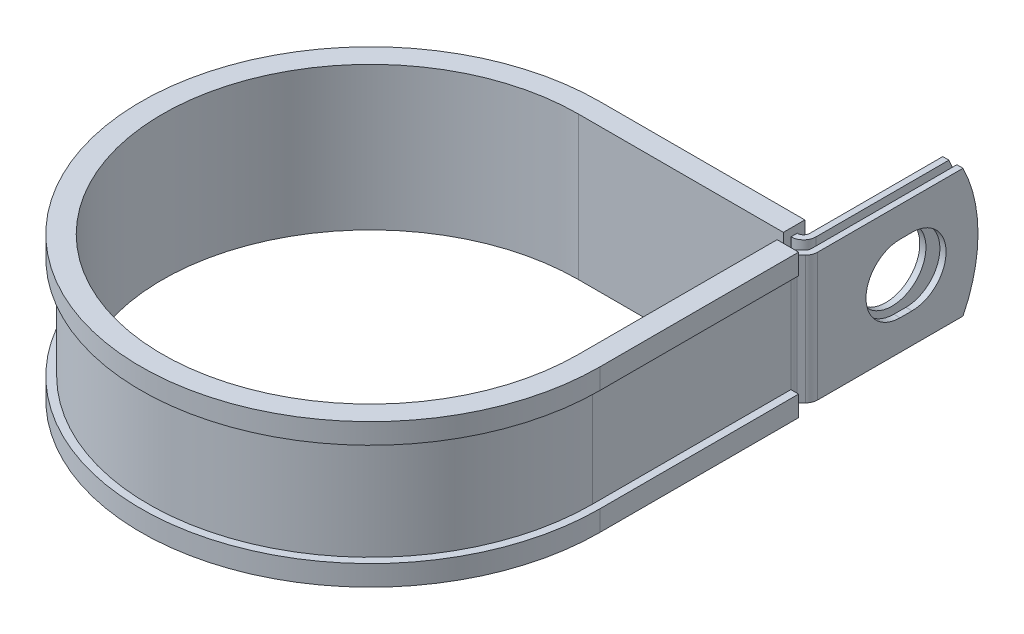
ISO-10303-21;
HEADER;
FILE_DESCRIPTION(('STEP AP214'),'2;1');
FILE_NAME('part.step','',(''),(''),'','','');
FILE_SCHEMA(('AUTOMOTIVE_DESIGN { 1 0 10303 214 1 1 1 1 }'));
ENDSEC;
DATA;
#1=APPLICATION_CONTEXT('core data for automotive mechanical design processes');
#2=APPLICATION_PROTOCOL_DEFINITION('international standard','automotive_design',2000,#1);
#3=PRODUCT_CONTEXT('',#1,'mechanical');
#4=PRODUCT('Part','Part','',(#3));
#5=PRODUCT_RELATED_PRODUCT_CATEGORY('part','',(#4));
#6=PRODUCT_DEFINITION_FORMATION('','',#4);
#7=PRODUCT_DEFINITION_CONTEXT('part definition',#1,'design');
#8=PRODUCT_DEFINITION('design','',#6,#7);
#9=PRODUCT_DEFINITION_SHAPE('','',#8);
#10=(LENGTH_UNIT() NAMED_UNIT(*) SI_UNIT(.MILLI.,.METRE.));
#11=(NAMED_UNIT(*) PLANE_ANGLE_UNIT() SI_UNIT($,.RADIAN.));
#12=(NAMED_UNIT(*) SI_UNIT($,.STERADIAN.) SOLID_ANGLE_UNIT());
#13=UNCERTAINTY_MEASURE_WITH_UNIT(LENGTH_MEASURE(1.E-05),#10,'distance_accuracy_value','');
#14=(GEOMETRIC_REPRESENTATION_CONTEXT(3) GLOBAL_UNCERTAINTY_ASSIGNED_CONTEXT((#13)) GLOBAL_UNIT_ASSIGNED_CONTEXT((#10,
#11,#12)) REPRESENTATION_CONTEXT('',''));
#15=CARTESIAN_POINT('',(0.,0.,0.));
#16=DIRECTION('',(0.,0.,1.));
#17=DIRECTION('',(1.,0.,0.));
#18=AXIS2_PLACEMENT_3D('',#15,#16,#17);
#19=CARTESIAN_POINT('',(43.4772698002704,-12.7,-42.799));
#20=DIRECTION('',(0.,1.,0.));
#21=DIRECTION('',(1.,0.,0.));
#22=AXIS2_PLACEMENT_3D('',#19,#20,#21);
#23=PLANE('',#22);
#24=DIRECTION('',(0.,0.,-1.));
#25=VECTOR('',#24,1.);
#26=CARTESIAN_POINT('',(40.6324698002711,-12.7,-42.799));
#27=LINE('',#26,#25);
#28=CARTESIAN_POINT('',(40.6324698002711,-12.7,-42.799));
#29=VERTEX_POINT('',#28);
#30=CARTESIAN_POINT('',(40.6324698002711,-12.7,-44.0182));
#31=VERTEX_POINT('',#30);
#32=EDGE_CURVE('E524',#29,#31,#27,.T.);
#33=ORIENTED_EDGE('',*,*,#32,.T.);
#34=DIRECTION('',(1.,0.,0.));
#35=VECTOR('',#34,1.);
#36=CARTESIAN_POINT('',(0.,-12.7,-44.0182));
#37=LINE('',#36,#35);
#38=CARTESIAN_POINT('',(40.6832698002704,-12.7,-44.0182));
#39=VERTEX_POINT('',#38);
#40=EDGE_CURVE('E411',#39,#31,#37,.F.);
#41=ORIENTED_EDGE('',*,*,#40,.F.);
#42=CARTESIAN_POINT('',(40.6832698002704,-12.7,-45.2374));
#43=DIRECTION('',(0.,1.,0.));
#44=DIRECTION('',(1.,0.,0.));
#45=AXIS2_PLACEMENT_3D('',#42,#43,#44);
#46=CIRCLE('',#45,1.2192);
#47=CARTESIAN_POINT('',(41.9024698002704,-12.7,-45.2374));
#48=VERTEX_POINT('',#47);
#49=EDGE_CURVE('E409',#48,#39,#46,.F.);
#50=ORIENTED_EDGE('',*,*,#49,.F.);
#51=DIRECTION('',(0.,0.,-1.));
#52=VECTOR('',#51,1.);
#53=CARTESIAN_POINT('',(41.9024698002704,-12.7,-74.5998));
#54=LINE('',#53,#52);
#55=CARTESIAN_POINT('',(41.9024698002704,-12.7,-71.6224683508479));
#56=VERTEX_POINT('',#55);
#57=EDGE_CURVE('E407',#56,#48,#54,.F.);
#58=ORIENTED_EDGE('',*,*,#57,.F.);
#59=DIRECTION('',(-1.,0.,0.));
#60=VECTOR('',#59,1.);
#61=CARTESIAN_POINT('',(45.9156698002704,-12.7,-71.6224683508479));
#62=LINE('',#61,#60);
#63=CARTESIAN_POINT('',(43.1216698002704,-12.7,-71.6224683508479));
#64=VERTEX_POINT('',#63);
#65=EDGE_CURVE('E12',#64,#56,#62,.T.);
#66=ORIENTED_EDGE('',*,*,#65,.F.);
#67=DIRECTION('',(0.,0.,1.));
#68=VECTOR('',#67,1.);
#69=CARTESIAN_POINT('',(43.1216698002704,-12.7,-74.5998));
#70=LINE('',#69,#68);
#71=CARTESIAN_POINT('',(43.1216698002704,-12.7,-45.2374));
#72=VERTEX_POINT('',#71);
#73=EDGE_CURVE('E405',#64,#72,#70,.T.);
#74=ORIENTED_EDGE('',*,*,#73,.T.);
#75=CARTESIAN_POINT('',(40.6832698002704,-12.7,-45.2374));
#76=DIRECTION('',(0.,-1.,0.));
#77=DIRECTION('',(0.,0.,1.));
#78=AXIS2_PLACEMENT_3D('',#75,#76,#77);
#79=CIRCLE('',#78,2.4384);
#80=CARTESIAN_POINT('',(40.6832698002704,-12.7,-42.799));
#81=VERTEX_POINT('',#80);
#82=EDGE_CURVE('E402',#72,#81,#79,.T.);
#83=ORIENTED_EDGE('',*,*,#82,.T.);
#84=DIRECTION('',(-1.,0.,0.));
#85=VECTOR('',#84,1.);
#86=CARTESIAN_POINT('',(0.,-12.7,-42.799));
#87=LINE('',#86,#85);
#88=EDGE_CURVE('E399',#81,#29,#87,.T.);
#89=ORIENTED_EDGE('',*,*,#88,.T.);
#90=EDGE_LOOP('',(#33,#41,#50,#58,#66,#74,#83,#89));
#91=FACE_BOUND('',#90,.T.);
#92=ADVANCED_FACE('F55',(#91),#23,.F.);
#93=CARTESIAN_POINT('',(43.4772698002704,12.7,-42.799));
#94=DIRECTION('',(0.,1.,0.));
#95=DIRECTION('',(1.,0.,0.));
#96=AXIS2_PLACEMENT_3D('',#93,#94,#95);
#97=PLANE('',#96);
#98=DIRECTION('',(1.,0.,0.));
#99=VECTOR('',#98,1.);
#100=CARTESIAN_POINT('',(0.,12.7,-44.0182));
#101=LINE('',#100,#99);
#102=CARTESIAN_POINT('',(40.6832698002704,12.7,-44.0182));
#103=VERTEX_POINT('',#102);
#104=CARTESIAN_POINT('',(40.6324698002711,12.7,-44.0182));
#105=VERTEX_POINT('',#104);
#106=EDGE_CURVE('E369',#103,#105,#101,.F.);
#107=ORIENTED_EDGE('',*,*,#106,.T.);
#108=DIRECTION('',(0.,0.,1.));
#109=VECTOR('',#108,1.);
#110=CARTESIAN_POINT('',(40.6324698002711,12.7,-44.0182));
#111=LINE('',#110,#109);
#112=CARTESIAN_POINT('',(40.6324698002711,12.7,-42.799));
#113=VERTEX_POINT('',#112);
#114=EDGE_CURVE('E518',#105,#113,#111,.T.);
#115=ORIENTED_EDGE('',*,*,#114,.T.);
#116=DIRECTION('',(-1.,0.,0.));
#117=VECTOR('',#116,1.);
#118=CARTESIAN_POINT('',(0.,12.7,-42.799));
#119=LINE('',#118,#117);
#120=CARTESIAN_POINT('',(40.6832698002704,12.7,-42.799));
#121=VERTEX_POINT('',#120);
#122=EDGE_CURVE('E626',#121,#113,#119,.T.);
#123=ORIENTED_EDGE('',*,*,#122,.F.);
#124=CARTESIAN_POINT('',(40.6832698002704,12.7,-45.2374));
#125=DIRECTION('',(0.,-1.,0.));
#126=DIRECTION('',(0.,0.,1.));
#127=AXIS2_PLACEMENT_3D('',#124,#125,#126);
#128=CIRCLE('',#127,2.4384);
#129=CARTESIAN_POINT('',(43.1216698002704,12.7,-45.2374));
#130=VERTEX_POINT('',#129);
#131=EDGE_CURVE('E371',#130,#121,#128,.T.);
#132=ORIENTED_EDGE('',*,*,#131,.F.);
#133=DIRECTION('',(0.,0.,1.));
#134=VECTOR('',#133,1.);
#135=CARTESIAN_POINT('',(43.1216698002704,12.7,-74.5998));
#136=LINE('',#135,#134);
#137=CARTESIAN_POINT('',(43.1216698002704,12.7,-71.6224683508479));
#138=VERTEX_POINT('',#137);
#139=EDGE_CURVE('E362',#138,#130,#136,.T.);
#140=ORIENTED_EDGE('',*,*,#139,.F.);
#141=DIRECTION('',(-1.,0.,0.));
#142=VECTOR('',#141,1.);
#143=CARTESIAN_POINT('',(45.9156698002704,12.7,-71.6224683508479));
#144=LINE('',#143,#142);
#145=CARTESIAN_POINT('',(41.9024698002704,12.7,-71.6224683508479));
#146=VERTEX_POINT('',#145);
#147=EDGE_CURVE('E63',#138,#146,#144,.T.);
#148=ORIENTED_EDGE('',*,*,#147,.T.);
#149=DIRECTION('',(0.,0.,-1.));
#150=VECTOR('',#149,1.);
#151=CARTESIAN_POINT('',(41.9024698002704,12.7,-74.5998));
#152=LINE('',#151,#150);
#153=CARTESIAN_POINT('',(41.9024698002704,12.7,-45.2374));
#154=VERTEX_POINT('',#153);
#155=EDGE_CURVE('E359',#146,#154,#152,.F.);
#156=ORIENTED_EDGE('',*,*,#155,.T.);
#157=CARTESIAN_POINT('',(40.6832698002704,12.7,-45.2374));
#158=DIRECTION('',(0.,1.,0.));
#159=DIRECTION('',(1.,0.,0.));
#160=AXIS2_PLACEMENT_3D('',#157,#158,#159);
#161=CIRCLE('',#160,1.2192);
#162=EDGE_CURVE('E367',#154,#103,#161,.F.);
#163=ORIENTED_EDGE('',*,*,#162,.T.);
#164=EDGE_LOOP('',(#107,#115,#123,#132,#140,#148,#156,#163));
#165=FACE_BOUND('',#164,.T.);
#166=ADVANCED_FACE('F358',(#165),#97,.T.);
#167=CARTESIAN_POINT('',(0.,12.7,-42.799));
#168=DIRECTION('',(0.,0.,1.));
#169=DIRECTION('',(1.,0.,0.));
#170=AXIS2_PLACEMENT_3D('',#167,#168,#169);
#171=PLANE('',#170);
#172=ORIENTED_EDGE('',*,*,#122,.T.);
#173=DIRECTION('',(0.,-1.,0.));
#174=VECTOR('',#173,1.);
#175=CARTESIAN_POINT('',(40.6324698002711,12.7,-42.799));
#176=LINE('',#175,#174);
#177=EDGE_CURVE('E521',#113,#29,#176,.T.);
#178=ORIENTED_EDGE('',*,*,#177,.T.);
#179=ORIENTED_EDGE('',*,*,#88,.F.);
#180=DIRECTION('',(0.,-1.,0.));
#181=VECTOR('',#180,1.);
#182=CARTESIAN_POINT('',(40.6832698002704,12.7,-42.799));
#183=LINE('',#182,#181);
#184=EDGE_CURVE('E345',#121,#81,#183,.T.);
#185=ORIENTED_EDGE('',*,*,#184,.F.);
#186=EDGE_LOOP('',(#172,#178,#179,#185));
#187=FACE_BOUND('',#186,.T.);
#188=ADVANCED_FACE('F636',(#187),#171,.T.);
#189=CARTESIAN_POINT('',(45.9156698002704,12.7,-42.799));
#190=DIRECTION('',(-1.,0.,0.));
#191=DIRECTION('',(0.,0.,1.));
#192=AXIS2_PLACEMENT_3D('',#189,#190,#191);
#193=PLANE('',#192);
#194=CARTESIAN_POINT('',(45.9156698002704,0.,-61.5187999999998));
#195=DIRECTION('',(1.,0.,0.));
#196=DIRECTION('',(0.,0.,-1.));
#197=AXIS2_PLACEMENT_3D('',#194,#195,#196);
#198=CIRCLE('',#197,6.7437);
#199=CARTESIAN_POINT('',(45.9156698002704,-6.7437,-61.5188000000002));
#200=VERTEX_POINT('',#199);
#201=CARTESIAN_POINT('',(45.9156698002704,6.7437,-61.5188000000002));
#202=VERTEX_POINT('',#201);
#203=EDGE_CURVE('E581',#200,#202,#198,.T.);
#204=ORIENTED_EDGE('',*,*,#203,.F.);
#205=DIRECTION('',(0.,0.,-1.));
#206=VECTOR('',#205,1.);
#207=CARTESIAN_POINT('',(45.9156698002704,-6.7437,-59.1311999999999));
#208=LINE('',#207,#206);
#209=CARTESIAN_POINT('',(45.9156698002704,-6.7437,-59.1311999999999));
#210=VERTEX_POINT('',#209);
#211=EDGE_CURVE('E584',#210,#200,#208,.T.);
#212=ORIENTED_EDGE('',*,*,#211,.F.);
#213=CARTESIAN_POINT('',(45.9156698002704,0.,-59.1311999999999));
#214=DIRECTION('',(1.,0.,0.));
#215=DIRECTION('',(0.,0.,-1.));
#216=AXIS2_PLACEMENT_3D('',#213,#214,#215);
#217=CIRCLE('',#216,6.7437);
#218=CARTESIAN_POINT('',(45.9156698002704,6.7437,-59.1311999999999));
#219=VERTEX_POINT('',#218);
#220=EDGE_CURVE('E577',#219,#210,#217,.T.);
#221=ORIENTED_EDGE('',*,*,#220,.F.);
#222=DIRECTION('',(0.,0.,1.));
#223=VECTOR('',#222,1.);
#224=CARTESIAN_POINT('',(45.9156698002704,6.7437,-59.1311999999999));
#225=LINE('',#224,#223);
#226=EDGE_CURVE('E578',#202,#219,#225,.T.);
#227=ORIENTED_EDGE('',*,*,#226,.F.);
#228=EDGE_LOOP('',(#204,#212,#221,#227));
#229=FACE_BOUND('',#228,.T.);
#230=DIRECTION('',(0.,0.,-1.));
#231=VECTOR('',#230,1.);
#232=CARTESIAN_POINT('',(45.9156698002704,-12.7,-42.799));
#233=LINE('',#232,#231);
#234=CARTESIAN_POINT('',(45.9156698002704,-12.7,-42.799));
#235=VERTEX_POINT('',#234);
#236=CARTESIAN_POINT('',(45.9156698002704,-12.7,-71.6224683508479));
#237=VERTEX_POINT('',#236);
#238=EDGE_CURVE('E383',#235,#237,#233,.T.);
#239=ORIENTED_EDGE('',*,*,#238,.T.);
#240=CARTESIAN_POINT('',(45.9156698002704,0.,-46.0248));
#241=DIRECTION('',(-1.,0.,0.));
#242=DIRECTION('',(0.,0.,1.));
#243=AXIS2_PLACEMENT_3D('',#240,#241,#242);
#244=CIRCLE('',#243,28.575);
#245=CARTESIAN_POINT('',(45.9156698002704,12.7,-71.6224683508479));
#246=VERTEX_POINT('',#245);
#247=EDGE_CURVE('E569',#246,#237,#244,.T.);
#248=ORIENTED_EDGE('',*,*,#247,.F.);
#249=DIRECTION('',(0.,0.,-1.));
#250=VECTOR('',#249,1.);
#251=CARTESIAN_POINT('',(45.9156698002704,12.7,-42.799));
#252=LINE('',#251,#250);
#253=CARTESIAN_POINT('',(45.9156698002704,12.7,-42.799));
#254=VERTEX_POINT('',#253);
#255=EDGE_CURVE('E420',#254,#246,#252,.T.);
#256=ORIENTED_EDGE('',*,*,#255,.F.);
#257=DIRECTION('',(0.,-1.,0.));
#258=VECTOR('',#257,1.);
#259=CARTESIAN_POINT('',(45.9156698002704,12.7,-42.799));
#260=LINE('',#259,#258);
#261=EDGE_CURVE('E382',#254,#235,#260,.T.);
#262=ORIENTED_EDGE('',*,*,#261,.T.);
#263=EDGE_LOOP('',(#239,#248,#256,#262));
#264=FACE_BOUND('',#263,.T.);
#265=ADVANCED_FACE('F57',(#229,#264),#193,.F.);
#266=CARTESIAN_POINT('',(44.6964698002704,12.7,-42.799));
#267=DIRECTION('',(-1.,0.,0.));
#268=DIRECTION('',(0.,0.,1.));
#269=AXIS2_PLACEMENT_3D('',#266,#267,#268);
#270=PLANE('',#269);
#271=DIRECTION('',(0.,0.,-1.));
#272=VECTOR('',#271,1.);
#273=CARTESIAN_POINT('',(44.6964698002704,-6.7437,-59.1311999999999));
#274=LINE('',#273,#272);
#275=CARTESIAN_POINT('',(44.6964698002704,-6.7437,-59.1311999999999));
#276=VERTEX_POINT('',#275);
#277=CARTESIAN_POINT('',(44.6964698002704,-6.7437,-61.5188000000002));
#278=VERTEX_POINT('',#277);
#279=EDGE_CURVE('E580',#276,#278,#274,.T.);
#280=ORIENTED_EDGE('',*,*,#279,.T.);
#281=CARTESIAN_POINT('',(44.6964698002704,0.,-61.5187999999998));
#282=DIRECTION('',(-1.,0.,0.));
#283=DIRECTION('',(0.,0.,1.));
#284=AXIS2_PLACEMENT_3D('',#281,#282,#283);
#285=CIRCLE('',#284,6.7437);
#286=CARTESIAN_POINT('',(44.6964698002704,6.7437,-61.5188000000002));
#287=VERTEX_POINT('',#286);
#288=EDGE_CURVE('E601',#278,#287,#285,.F.);
#289=ORIENTED_EDGE('',*,*,#288,.T.);
#290=DIRECTION('',(0.,0.,1.));
#291=VECTOR('',#290,1.);
#292=CARTESIAN_POINT('',(44.6964698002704,6.7437,-59.1311999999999));
#293=LINE('',#292,#291);
#294=CARTESIAN_POINT('',(44.6964698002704,6.7437,-59.1311999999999));
#295=VERTEX_POINT('',#294);
#296=EDGE_CURVE('E597',#287,#295,#293,.T.);
#297=ORIENTED_EDGE('',*,*,#296,.T.);
#298=CARTESIAN_POINT('',(44.6964698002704,0.,-59.1311999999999));
#299=DIRECTION('',(-1.,0.,0.));
#300=DIRECTION('',(0.,0.,1.));
#301=AXIS2_PLACEMENT_3D('',#298,#299,#300);
#302=CIRCLE('',#301,6.7437);
#303=EDGE_CURVE('E592',#295,#276,#302,.F.);
#304=ORIENTED_EDGE('',*,*,#303,.T.);
#305=EDGE_LOOP('',(#280,#289,#297,#304));
#306=FACE_BOUND('',#305,.T.);
#307=CARTESIAN_POINT('',(44.6964698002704,0.,-46.0248));
#308=DIRECTION('',(-1.,0.,0.));
#309=DIRECTION('',(0.,0.,1.));
#310=AXIS2_PLACEMENT_3D('',#307,#308,#309);
#311=CIRCLE('',#310,28.575);
#312=CARTESIAN_POINT('',(44.6964698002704,12.7,-71.6224683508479));
#313=VERTEX_POINT('',#312);
#314=CARTESIAN_POINT('',(44.6964698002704,-12.7,-71.6224683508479));
#315=VERTEX_POINT('',#314);
#316=EDGE_CURVE('E77',#313,#315,#311,.T.);
#317=ORIENTED_EDGE('',*,*,#316,.T.);
#318=DIRECTION('',(0.,0.,-1.));
#319=VECTOR('',#318,1.);
#320=CARTESIAN_POINT('',(44.6964698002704,-12.7,-42.799));
#321=LINE('',#320,#319);
#322=CARTESIAN_POINT('',(44.6964698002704,-12.7,-42.799));
#323=VERTEX_POINT('',#322);
#324=EDGE_CURVE('E386',#323,#315,#321,.T.);
#325=ORIENTED_EDGE('',*,*,#324,.F.);
#326=DIRECTION('',(0.,-1.,0.));
#327=VECTOR('',#326,1.);
#328=CARTESIAN_POINT('',(44.6964698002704,12.7,-42.799));
#329=LINE('',#328,#327);
#330=CARTESIAN_POINT('',(44.6964698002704,12.7,-42.799));
#331=VERTEX_POINT('',#330);
#332=EDGE_CURVE('E353',#331,#323,#329,.T.);
#333=ORIENTED_EDGE('',*,*,#332,.F.);
#334=DIRECTION('',(0.,0.,-1.));
#335=VECTOR('',#334,1.);
#336=CARTESIAN_POINT('',(44.6964698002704,12.7,-42.799));
#337=LINE('',#336,#335);
#338=EDGE_CURVE('E616',#331,#313,#337,.T.);
#339=ORIENTED_EDGE('',*,*,#338,.T.);
#340=EDGE_LOOP('',(#317,#325,#333,#339));
#341=FACE_BOUND('',#340,.T.);
#342=ADVANCED_FACE('F690',(#306,#341),#270,.T.);
#343=CARTESIAN_POINT('',(43.1216698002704,12.7,-74.5998));
#344=DIRECTION('',(1.,0.,0.));
#345=DIRECTION('',(0.,0.,-1.));
#346=AXIS2_PLACEMENT_3D('',#343,#344,#345);
#347=PLANE('',#346);
#348=CARTESIAN_POINT('',(43.1216698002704,0.,-60.325));
#349=DIRECTION('',(1.,0.,0.));
#350=DIRECTION('',(0.,0.,-1.));
#351=AXIS2_PLACEMENT_3D('',#348,#349,#350);
#352=CIRCLE('',#351,6.7437);
#353=CARTESIAN_POINT('',(43.1216698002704,0.,-67.0687));
#354=VERTEX_POINT('',#353);
#355=EDGE_CURVE('E387',#354,#354,#352,.F.);
#356=ORIENTED_EDGE('',*,*,#355,.T.);
#357=EDGE_LOOP('',(#356));
#358=FACE_BOUND('',#357,.T.);
#359=ORIENTED_EDGE('',*,*,#73,.F.);
#360=CARTESIAN_POINT('',(43.1216698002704,0.,-46.0248));
#361=DIRECTION('',(1.,0.,0.));
#362=DIRECTION('',(0.,0.,-1.));
#363=AXIS2_PLACEMENT_3D('',#360,#361,#362);
#364=CIRCLE('',#363,28.575);
#365=EDGE_CURVE('E574',#64,#138,#364,.T.);
#366=ORIENTED_EDGE('',*,*,#365,.T.);
#367=ORIENTED_EDGE('',*,*,#139,.T.);
#368=DIRECTION('',(0.,-1.,0.));
#369=VECTOR('',#368,1.);
#370=CARTESIAN_POINT('',(43.1216698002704,12.7,-45.2374));
#371=LINE('',#370,#369);
#372=EDGE_CURVE('E342',#130,#72,#371,.T.);
#373=ORIENTED_EDGE('',*,*,#372,.T.);
#374=EDGE_LOOP('',(#359,#366,#367,#373));
#375=FACE_BOUND('',#374,.T.);
#376=ADVANCED_FACE('F642',(#358,#375),#347,.T.);
#377=CARTESIAN_POINT('',(41.9024698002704,12.7,-74.5998));
#378=DIRECTION('',(1.,0.,0.));
#379=DIRECTION('',(0.,0.,-1.));
#380=AXIS2_PLACEMENT_3D('',#377,#378,#379);
#381=PLANE('',#380);
#382=CARTESIAN_POINT('',(41.9024698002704,0.,-60.325));
#383=DIRECTION('',(-1.,0.,0.));
#384=DIRECTION('',(0.,0.,1.));
#385=AXIS2_PLACEMENT_3D('',#382,#383,#384);
#386=CIRCLE('',#385,6.7437);
#387=CARTESIAN_POINT('',(41.9024698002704,0.,-53.5813));
#388=VERTEX_POINT('',#387);
#389=EDGE_CURVE('E609',#388,#388,#386,.T.);
#390=ORIENTED_EDGE('',*,*,#389,.F.);
#391=EDGE_LOOP('',(#390));
#392=FACE_BOUND('',#391,.T.);
#393=CARTESIAN_POINT('',(41.9024698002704,0.,-46.0248));
#394=DIRECTION('',(-1.,0.,0.));
#395=DIRECTION('',(0.,0.,1.));
#396=AXIS2_PLACEMENT_3D('',#393,#394,#395);
#397=CIRCLE('',#396,28.575);
#398=EDGE_CURVE('E69',#146,#56,#397,.T.);
#399=ORIENTED_EDGE('',*,*,#398,.T.);
#400=ORIENTED_EDGE('',*,*,#57,.T.);
#401=DIRECTION('',(0.,-1.,0.));
#402=VECTOR('',#401,1.);
#403=CARTESIAN_POINT('',(41.9024698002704,12.7,-45.2374));
#404=LINE('',#403,#402);
#405=EDGE_CURVE('E339',#154,#48,#404,.T.);
#406=ORIENTED_EDGE('',*,*,#405,.F.);
#407=ORIENTED_EDGE('',*,*,#155,.F.);
#408=EDGE_LOOP('',(#399,#400,#406,#407));
#409=FACE_BOUND('',#408,.T.);
#410=ADVANCED_FACE('F365',(#392,#409),#381,.F.);
#411=CARTESIAN_POINT('',(45.2374,-12.7,-39.3865026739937));
#412=DIRECTION('',(0.,1.,0.));
#413=DIRECTION('',(1.,0.,0.));
#414=AXIS2_PLACEMENT_3D('',#411,#412,#413);
#415=CIRCLE('',#414,1.2192);
#416=CARTESIAN_POINT('',(44.0182,-12.7,-39.3865026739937));
#417=VERTEX_POINT('',#416);
#418=CARTESIAN_POINT('',(44.3752954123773,-12.7,-40.2486072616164));
#419=VERTEX_POINT('',#418);
#420=EDGE_CURVE('E414',#417,#419,#415,.F.);
#421=ORIENTED_EDGE('',*,*,#420,.F.);
#422=DIRECTION('',(1.,0.,0.));
#423=VECTOR('',#422,1.);
#424=CARTESIAN_POINT('',(42.799,-12.7,-39.3865026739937));
#425=LINE('',#424,#423);
#426=CARTESIAN_POINT('',(42.799,-12.7,-39.3865026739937));
#427=VERTEX_POINT('',#426);
#428=EDGE_CURVE('E452',#427,#417,#425,.T.);
#429=ORIENTED_EDGE('',*,*,#428,.F.);
#430=CARTESIAN_POINT('',(45.2374,-12.7,-39.3865026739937));
#431=DIRECTION('',(0.,-1.,0.));
#432=DIRECTION('',(0.,0.,1.));
#433=AXIS2_PLACEMENT_3D('',#430,#431,#432);
#434=CIRCLE('',#433,2.4384);
#435=CARTESIAN_POINT('',(43.5131908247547,-12.7,-41.110711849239));
#436=VERTEX_POINT('',#435);
#437=EDGE_CURVE('E396',#427,#436,#434,.T.);
#438=ORIENTED_EDGE('',*,*,#437,.T.);
#439=DIRECTION('',(0.707106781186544,0.,-0.70710678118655));
#440=VECTOR('',#439,1.);
#441=CARTESIAN_POINT('',(43.5131908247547,-12.7,-41.110711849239));
#442=LINE('',#441,#440);
#443=CARTESIAN_POINT('',(44.3393743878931,-12.7,-41.9368954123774));
#444=VERTEX_POINT('',#443);
#445=EDGE_CURVE('E393',#436,#444,#442,.T.);
#446=ORIENTED_EDGE('',*,*,#445,.T.);
#447=CARTESIAN_POINT('',(43.4772698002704,-12.7,-42.799));
#448=DIRECTION('',(0.,1.,0.));
#449=DIRECTION('',(0.,0.,1.));
#450=AXIS2_PLACEMENT_3D('',#447,#448,#449);
#451=CIRCLE('',#450,1.2192);
#452=EDGE_CURVE('E390',#444,#323,#451,.T.);
#453=ORIENTED_EDGE('',*,*,#452,.T.);
#454=ORIENTED_EDGE('',*,*,#324,.T.);
#455=DIRECTION('',(-1.,0.,0.));
#456=VECTOR('',#455,1.);
#457=CARTESIAN_POINT('',(45.9156698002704,-12.7,-71.6224683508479));
#458=LINE('',#457,#456);
#459=EDGE_CURVE('E567',#237,#315,#458,.T.);
#460=ORIENTED_EDGE('',*,*,#459,.F.);
#461=ORIENTED_EDGE('',*,*,#238,.F.);
#462=CARTESIAN_POINT('',(43.4772698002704,-12.7,-42.799));
#463=DIRECTION('',(0.,1.,0.));
#464=DIRECTION('',(1.,0.,0.));
#465=AXIS2_PLACEMENT_3D('',#462,#463,#464);
#466=CIRCLE('',#465,2.4384);
#467=CARTESIAN_POINT('',(45.2014789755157,-12.7,-41.0747908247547));
#468=VERTEX_POINT('',#467);
#469=EDGE_CURVE('E418',#468,#235,#466,.T.);
#470=ORIENTED_EDGE('',*,*,#469,.F.);
#471=DIRECTION('',(0.707106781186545,0.,-0.707106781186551));
#472=VECTOR('',#471,1.);
#473=CARTESIAN_POINT('',(44.3752954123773,-12.7,-40.2486072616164));
#474=LINE('',#473,#472);
#475=EDGE_CURVE('E416',#419,#468,#474,.T.);
#476=ORIENTED_EDGE('',*,*,#475,.F.);
#477=EDGE_LOOP('',(#421,#429,#438,#446,#453,#454,#460,#461,#470,#476));
#478=FACE_BOUND('',#477,.T.);
#479=ADVANCED_FACE('F676',(#478),#23,.F.);
#480=DIRECTION('',(-1.,0.,0.));
#481=VECTOR('',#480,1.);
#482=CARTESIAN_POINT('',(44.0182,12.7,-39.3865026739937));
#483=LINE('',#482,#481);
#484=CARTESIAN_POINT('',(44.0182,12.7,-39.3865026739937));
#485=VERTEX_POINT('',#484);
#486=CARTESIAN_POINT('',(42.799,12.7,-39.3865026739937));
#487=VERTEX_POINT('',#486);
#488=EDGE_CURVE('E441',#485,#487,#483,.T.);
#489=ORIENTED_EDGE('',*,*,#488,.F.);
#490=CARTESIAN_POINT('',(45.2374,12.7,-39.3865026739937));
#491=DIRECTION('',(0.,1.,0.));
#492=DIRECTION('',(1.,0.,0.));
#493=AXIS2_PLACEMENT_3D('',#490,#491,#492);
#494=CIRCLE('',#493,1.2192);
#495=CARTESIAN_POINT('',(44.3752954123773,12.7,-40.2486072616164));
#496=VERTEX_POINT('',#495);
#497=EDGE_CURVE('E376',#485,#496,#494,.F.);
#498=ORIENTED_EDGE('',*,*,#497,.T.);
#499=DIRECTION('',(0.707106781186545,0.,-0.707106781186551));
#500=VECTOR('',#499,1.);
#501=CARTESIAN_POINT('',(44.3752954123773,12.7,-40.2486072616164));
#502=LINE('',#501,#500);
#503=CARTESIAN_POINT('',(45.2014789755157,12.7,-41.0747908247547));
#504=VERTEX_POINT('',#503);
#505=EDGE_CURVE('E378',#496,#504,#502,.T.);
#506=ORIENTED_EDGE('',*,*,#505,.T.);
#507=CARTESIAN_POINT('',(43.4772698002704,12.7,-42.799));
#508=DIRECTION('',(0.,1.,0.));
#509=DIRECTION('',(1.,0.,0.));
#510=AXIS2_PLACEMENT_3D('',#507,#508,#509);
#511=CIRCLE('',#510,2.4384);
#512=EDGE_CURVE('E380',#504,#254,#511,.T.);
#513=ORIENTED_EDGE('',*,*,#512,.T.);
#514=ORIENTED_EDGE('',*,*,#255,.T.);
#515=DIRECTION('',(-1.,0.,0.));
#516=VECTOR('',#515,1.);
#517=CARTESIAN_POINT('',(45.9156698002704,12.7,-71.6224683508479));
#518=LINE('',#517,#516);
#519=EDGE_CURVE('E571',#246,#313,#518,.T.);
#520=ORIENTED_EDGE('',*,*,#519,.T.);
#521=ORIENTED_EDGE('',*,*,#338,.F.);
#522=CARTESIAN_POINT('',(43.4772698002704,12.7,-42.799));
#523=DIRECTION('',(0.,1.,0.));
#524=DIRECTION('',(0.,0.,1.));
#525=AXIS2_PLACEMENT_3D('',#522,#523,#524);
#526=CIRCLE('',#525,1.2192);
#527=CARTESIAN_POINT('',(44.3393743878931,12.7,-41.9368954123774));
#528=VERTEX_POINT('',#527);
#529=EDGE_CURVE('E619',#528,#331,#526,.T.);
#530=ORIENTED_EDGE('',*,*,#529,.F.);
#531=DIRECTION('',(0.707106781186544,0.,-0.70710678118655));
#532=VECTOR('',#531,1.);
#533=CARTESIAN_POINT('',(43.5131908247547,12.7,-41.110711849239));
#534=LINE('',#533,#532);
#535=CARTESIAN_POINT('',(43.5131908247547,12.7,-41.110711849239));
#536=VERTEX_POINT('',#535);
#537=EDGE_CURVE('E622',#536,#528,#534,.T.);
#538=ORIENTED_EDGE('',*,*,#537,.F.);
#539=CARTESIAN_POINT('',(45.2374,12.7,-39.3865026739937));
#540=DIRECTION('',(0.,-1.,0.));
#541=DIRECTION('',(0.,0.,1.));
#542=AXIS2_PLACEMENT_3D('',#539,#540,#541);
#543=CIRCLE('',#542,2.4384);
#544=EDGE_CURVE('E451',#487,#536,#543,.T.);
#545=ORIENTED_EDGE('',*,*,#544,.F.);
#546=EDGE_LOOP('',(#489,#498,#506,#513,#514,#520,#521,#530,#538,#545));
#547=FACE_BOUND('',#546,.T.);
#548=ADVANCED_FACE('F448',(#547),#97,.T.);
#549=CARTESIAN_POINT('',(43.4772698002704,12.7,-42.799));
#550=DIRECTION('',(0.,-1.,0.));
#551=DIRECTION('',(0.,0.,-1.));
#552=AXIS2_PLACEMENT_3D('',#549,#550,#551);
#553=CYLINDRICAL_SURFACE('',#552,1.2192);
#554=ORIENTED_EDGE('',*,*,#452,.F.);
#555=DIRECTION('',(0.,-1.,0.));
#556=VECTOR('',#555,1.);
#557=CARTESIAN_POINT('',(44.3393743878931,12.7,-41.9368954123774));
#558=LINE('',#557,#556);
#559=EDGE_CURVE('E351',#528,#444,#558,.T.);
#560=ORIENTED_EDGE('',*,*,#559,.F.);
#561=ORIENTED_EDGE('',*,*,#529,.T.);
#562=ORIENTED_EDGE('',*,*,#332,.T.);
#563=EDGE_LOOP('',(#554,#560,#561,#562));
#564=FACE_BOUND('',#563,.T.);
#565=ADVANCED_FACE('F686',(#564),#553,.F.);
#566=CARTESIAN_POINT('',(43.5131908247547,12.7,-41.110711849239));
#567=DIRECTION('',(-0.707106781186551,0.,-0.707106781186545));
#568=DIRECTION('',(-0.707106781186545,0.,0.707106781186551));
#569=AXIS2_PLACEMENT_3D('',#566,#567,#568);
#570=PLANE('',#569);
#571=ORIENTED_EDGE('',*,*,#445,.F.);
#572=DIRECTION('',(0.,-1.,0.));
#573=VECTOR('',#572,1.);
#574=CARTESIAN_POINT('',(43.5131908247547,12.7,-41.110711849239));
#575=LINE('',#574,#573);
#576=EDGE_CURVE('E349',#536,#436,#575,.T.);
#577=ORIENTED_EDGE('',*,*,#576,.F.);
#578=ORIENTED_EDGE('',*,*,#537,.T.);
#579=ORIENTED_EDGE('',*,*,#559,.T.);
#580=EDGE_LOOP('',(#571,#577,#578,#579));
#581=FACE_BOUND('',#580,.T.);
#582=ADVANCED_FACE('F681',(#581),#570,.T.);
#583=CARTESIAN_POINT('',(45.2374,12.7,-39.3865026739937));
#584=DIRECTION('',(0.,-1.,0.));
#585=DIRECTION('',(0.,0.,-1.));
#586=AXIS2_PLACEMENT_3D('',#583,#584,#585);
#587=CYLINDRICAL_SURFACE('',#586,2.4384);
#588=ORIENTED_EDGE('',*,*,#437,.F.);
#589=DIRECTION('',(0.,-1.,0.));
#590=VECTOR('',#589,1.);
#591=CARTESIAN_POINT('',(42.799,12.7,-39.3865026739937));
#592=LINE('',#591,#590);
#593=EDGE_CURVE('E347',#487,#427,#592,.T.);
#594=ORIENTED_EDGE('',*,*,#593,.F.);
#595=ORIENTED_EDGE('',*,*,#544,.T.);
#596=ORIENTED_EDGE('',*,*,#576,.T.);
#597=EDGE_LOOP('',(#588,#594,#595,#596));
#598=FACE_BOUND('',#597,.T.);
#599=ADVANCED_FACE('F678',(#598),#587,.T.);
#600=CARTESIAN_POINT('',(40.6832698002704,12.7,-45.2374));
#601=DIRECTION('',(0.,-1.,0.));
#602=DIRECTION('',(0.,0.,-1.));
#603=AXIS2_PLACEMENT_3D('',#600,#601,#602);
#604=CYLINDRICAL_SURFACE('',#603,2.4384);
#605=ORIENTED_EDGE('',*,*,#82,.F.);
#606=ORIENTED_EDGE('',*,*,#372,.F.);
#607=ORIENTED_EDGE('',*,*,#131,.T.);
#608=ORIENTED_EDGE('',*,*,#184,.T.);
#609=EDGE_LOOP('',(#605,#606,#607,#608));
#610=FACE_BOUND('',#609,.T.);
#611=ADVANCED_FACE('F632',(#610),#604,.T.);
#612=CARTESIAN_POINT('',(40.6832698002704,12.7,-45.2374));
#613=DIRECTION('',(0.,-1.,0.));
#614=DIRECTION('',(0.,0.,-1.));
#615=AXIS2_PLACEMENT_3D('',#612,#613,#614);
#616=CYLINDRICAL_SURFACE('',#615,1.2192);
#617=ORIENTED_EDGE('',*,*,#49,.T.);
#618=DIRECTION('',(0.,-1.,0.));
#619=VECTOR('',#618,1.);
#620=CARTESIAN_POINT('',(40.6832698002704,12.7,-44.0182));
#621=LINE('',#620,#619);
#622=EDGE_CURVE('E330',#103,#39,#621,.T.);
#623=ORIENTED_EDGE('',*,*,#622,.F.);
#624=ORIENTED_EDGE('',*,*,#162,.F.);
#625=ORIENTED_EDGE('',*,*,#405,.T.);
#626=EDGE_LOOP('',(#617,#623,#624,#625));
#627=FACE_BOUND('',#626,.T.);
#628=ADVANCED_FACE('F647',(#627),#616,.F.);
#629=CARTESIAN_POINT('',(0.,12.7,-44.0182));
#630=DIRECTION('',(0.,0.,1.));
#631=DIRECTION('',(1.,0.,0.));
#632=AXIS2_PLACEMENT_3D('',#629,#630,#631);
#633=PLANE('',#632);
#634=DIRECTION('',(0.,-1.,0.));
#635=VECTOR('',#634,1.);
#636=CARTESIAN_POINT('',(0.,12.7,-44.0182));
#637=LINE('',#636,#635);
#638=CARTESIAN_POINT('',(6.1745023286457E-13,10.16,-44.0182));
#639=VERTEX_POINT('',#638);
#640=CARTESIAN_POINT('',(6.17450232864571E-13,-10.16,-44.0182));
#641=VERTEX_POINT('',#640);
#642=EDGE_CURVE('E321',#639,#641,#637,.T.);
#643=ORIENTED_EDGE('',*,*,#642,.F.);
#644=DIRECTION('',(1.,0.,0.));
#645=VECTOR('',#644,1.);
#646=CARTESIAN_POINT('',(6.1745023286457E-13,10.16,-44.0182));
#647=LINE('',#646,#645);
#648=CARTESIAN_POINT('',(40.6324698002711,10.16,-44.0182));
#649=VERTEX_POINT('',#648);
#650=EDGE_CURVE('E564',#639,#649,#647,.T.);
#651=ORIENTED_EDGE('',*,*,#650,.T.);
#652=DIRECTION('',(0.,1.,0.));
#653=VECTOR('',#652,1.);
#654=CARTESIAN_POINT('',(40.6324698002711,12.7,-44.0182));
#655=LINE('',#654,#653);
#656=EDGE_CURVE('E515',#649,#105,#655,.T.);
#657=ORIENTED_EDGE('',*,*,#656,.T.);
#658=ORIENTED_EDGE('',*,*,#106,.F.);
#659=ORIENTED_EDGE('',*,*,#622,.T.);
#660=ORIENTED_EDGE('',*,*,#40,.T.);
#661=DIRECTION('',(0.,1.,0.));
#662=VECTOR('',#661,1.);
#663=CARTESIAN_POINT('',(40.6324698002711,-12.7,-44.0182));
#664=LINE('',#663,#662);
#665=CARTESIAN_POINT('',(40.6324698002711,-10.16,-44.0182));
#666=VERTEX_POINT('',#665);
#667=EDGE_CURVE('E527',#31,#666,#664,.T.);
#668=ORIENTED_EDGE('',*,*,#667,.T.);
#669=DIRECTION('',(1.,0.,0.));
#670=VECTOR('',#669,1.);
#671=CARTESIAN_POINT('',(6.17450232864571E-13,-10.16,-44.0182));
#672=LINE('',#671,#670);
#673=EDGE_CURVE('E544',#641,#666,#672,.T.);
#674=ORIENTED_EDGE('',*,*,#673,.F.);
#675=EDGE_LOOP('',(#643,#651,#657,#658,#659,#660,#668,#674));
#676=FACE_BOUND('',#675,.T.);
#677=ADVANCED_FACE('F651',(#676),#633,.F.);
#678=CARTESIAN_POINT('',(0.,12.7,0.));
#679=DIRECTION('',(0.,-1.,0.));
#680=DIRECTION('',(0.,0.,-1.));
#681=AXIS2_PLACEMENT_3D('',#678,#679,#680);
#682=CYLINDRICAL_SURFACE('',#681,44.0182);
#683=DIRECTION('',(0.,-1.,0.));
#684=VECTOR('',#683,1.);
#685=CARTESIAN_POINT('',(44.0182,12.7,0.));
#686=LINE('',#685,#684);
#687=CARTESIAN_POINT('',(44.0182,10.16,0.));
#688=VERTEX_POINT('',#687);
#689=CARTESIAN_POINT('',(44.0182,-10.16,0.));
#690=VERTEX_POINT('',#689);
#691=EDGE_CURVE('E319',#688,#690,#686,.T.);
#692=ORIENTED_EDGE('',*,*,#691,.F.);
#693=CARTESIAN_POINT('',(0.,10.16,0.));
#694=DIRECTION('',(0.,-1.,0.));
#695=DIRECTION('',(0.,0.,-1.));
#696=AXIS2_PLACEMENT_3D('',#693,#694,#695);
#697=CIRCLE('',#696,44.0182);
#698=EDGE_CURVE('E513',#688,#639,#697,.T.);
#699=ORIENTED_EDGE('',*,*,#698,.T.);
#700=ORIENTED_EDGE('',*,*,#642,.T.);
#701=CARTESIAN_POINT('',(0.,-10.16,0.));
#702=DIRECTION('',(0.,-1.,0.));
#703=DIRECTION('',(0.,0.,-1.));
#704=AXIS2_PLACEMENT_3D('',#701,#702,#703);
#705=CIRCLE('',#704,44.0182);
#706=EDGE_CURVE('E302',#690,#641,#705,.T.);
#707=ORIENTED_EDGE('',*,*,#706,.F.);
#708=EDGE_LOOP('',(#692,#699,#700,#707));
#709=FACE_BOUND('',#708,.T.);
#710=ADVANCED_FACE('F317',(#709),#682,.T.);
#711=CARTESIAN_POINT('',(44.0182,12.7,0.));
#712=DIRECTION('',(-1.,0.,0.));
#713=DIRECTION('',(0.,0.,1.));
#714=AXIS2_PLACEMENT_3D('',#711,#712,#713);
#715=PLANE('',#714);
#716=DIRECTION('',(0.,-1.,0.));
#717=VECTOR('',#716,1.);
#718=CARTESIAN_POINT('',(44.0182,12.7,-39.3865026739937));
#719=LINE('',#718,#717);
#720=CARTESIAN_POINT('',(44.0182,10.16,-39.3865026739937));
#721=VERTEX_POINT('',#720);
#722=CARTESIAN_POINT('',(44.0182,-10.16,-39.3865026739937));
#723=VERTEX_POINT('',#722);
#724=EDGE_CURVE('E333',#721,#723,#719,.T.);
#725=ORIENTED_EDGE('',*,*,#724,.F.);
#726=DIRECTION('',(0.,0.,-1.));
#727=VECTOR('',#726,1.);
#728=CARTESIAN_POINT('',(44.0182,10.16,0.));
#729=LINE('',#728,#727);
#730=EDGE_CURVE('E327',#688,#721,#729,.T.);
#731=ORIENTED_EDGE('',*,*,#730,.F.);
#732=ORIENTED_EDGE('',*,*,#691,.T.);
#733=DIRECTION('',(0.,0.,-1.));
#734=VECTOR('',#733,1.);
#735=CARTESIAN_POINT('',(44.0182,-10.16,0.));
#736=LINE('',#735,#734);
#737=EDGE_CURVE('E298',#690,#723,#736,.T.);
#738=ORIENTED_EDGE('',*,*,#737,.T.);
#739=EDGE_LOOP('',(#725,#731,#732,#738));
#740=FACE_BOUND('',#739,.T.);
#741=ADVANCED_FACE('F326',(#740),#715,.F.);
#742=CARTESIAN_POINT('',(45.2374,12.7,-39.3865026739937));
#743=DIRECTION('',(0.,-1.,0.));
#744=DIRECTION('',(0.,0.,-1.));
#745=AXIS2_PLACEMENT_3D('',#742,#743,#744);
#746=CYLINDRICAL_SURFACE('',#745,1.2192);
#747=ORIENTED_EDGE('',*,*,#420,.T.);
#748=DIRECTION('',(0.,-1.,0.));
#749=VECTOR('',#748,1.);
#750=CARTESIAN_POINT('',(44.3752954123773,12.7,-40.2486072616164));
#751=LINE('',#750,#749);
#752=EDGE_CURVE('E425',#496,#419,#751,.T.);
#753=ORIENTED_EDGE('',*,*,#752,.F.);
#754=ORIENTED_EDGE('',*,*,#497,.F.);
#755=EDGE_CURVE('E328',#485,#721,#719,.T.);
#756=ORIENTED_EDGE('',*,*,#755,.T.);
#757=ORIENTED_EDGE('',*,*,#724,.T.);
#758=DIRECTION('',(0.,1.,0.));
#759=VECTOR('',#758,1.);
#760=CARTESIAN_POINT('',(44.0182,-12.7,-39.3865026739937));
#761=LINE('',#760,#759);
#762=EDGE_CURVE('E434',#417,#723,#761,.T.);
#763=ORIENTED_EDGE('',*,*,#762,.F.);
#764=EDGE_LOOP('',(#747,#753,#754,#756,#757,#763));
#765=FACE_BOUND('',#764,.T.);
#766=ADVANCED_FACE('F433',(#765),#746,.F.);
#767=CARTESIAN_POINT('',(44.3752954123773,12.7,-40.2486072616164));
#768=DIRECTION('',(-0.70710678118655,0.,-0.707106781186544));
#769=DIRECTION('',(-0.707106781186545,0.,0.707106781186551));
#770=AXIS2_PLACEMENT_3D('',#767,#768,#769);
#771=PLANE('',#770);
#772=ORIENTED_EDGE('',*,*,#475,.T.);
#773=DIRECTION('',(0.,-1.,0.));
#774=VECTOR('',#773,1.);
#775=CARTESIAN_POINT('',(45.2014789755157,12.7,-41.0747908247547));
#776=LINE('',#775,#774);
#777=EDGE_CURVE('E423',#504,#468,#776,.T.);
#778=ORIENTED_EDGE('',*,*,#777,.F.);
#779=ORIENTED_EDGE('',*,*,#505,.F.);
#780=ORIENTED_EDGE('',*,*,#752,.T.);
#781=EDGE_LOOP('',(#772,#778,#779,#780));
#782=FACE_BOUND('',#781,.T.);
#783=ADVANCED_FACE('F702',(#782),#771,.F.);
#784=CARTESIAN_POINT('',(43.4772698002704,12.7,-42.799));
#785=DIRECTION('',(0.,-1.,0.));
#786=DIRECTION('',(0.,0.,-1.));
#787=AXIS2_PLACEMENT_3D('',#784,#785,#786);
#788=CYLINDRICAL_SURFACE('',#787,2.4384);
#789=ORIENTED_EDGE('',*,*,#469,.T.);
#790=ORIENTED_EDGE('',*,*,#261,.F.);
#791=ORIENTED_EDGE('',*,*,#512,.F.);
#792=ORIENTED_EDGE('',*,*,#777,.T.);
#793=EDGE_LOOP('',(#789,#790,#791,#792));
#794=FACE_BOUND('',#793,.T.);
#795=ADVANCED_FACE('F700',(#794),#788,.T.);
#796=CARTESIAN_POINT('',(62.1957338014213,0.,-60.325));
#797=DIRECTION('',(-1.,0.,0.));
#798=DIRECTION('',(0.,0.,1.));
#799=AXIS2_PLACEMENT_3D('',#796,#797,#798);
#800=CYLINDRICAL_SURFACE('',#799,6.7437);
#801=ORIENTED_EDGE('',*,*,#389,.T.);
#802=EDGE_LOOP('',(#801));
#803=FACE_BOUND('',#802,.T.);
#804=ORIENTED_EDGE('',*,*,#355,.F.);
#805=EDGE_LOOP('',(#804));
#806=FACE_BOUND('',#805,.T.);
#807=ADVANCED_FACE('F709',(#803,#806),#800,.F.);
#808=CARTESIAN_POINT('',(23.8655892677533,-6.7437,-59.1311999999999));
#809=DIRECTION('',(0.,-1.,0.));
#810=DIRECTION('',(0.,0.,-1.));
#811=AXIS2_PLACEMENT_3D('',#808,#809,#810);
#812=PLANE('',#811);
#813=DIRECTION('',(1.,0.,0.));
#814=VECTOR('',#813,1.);
#815=CARTESIAN_POINT('',(23.8655892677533,-6.7437,-59.1311999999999));
#816=LINE('',#815,#814);
#817=EDGE_CURVE('E595',#276,#210,#816,.T.);
#818=ORIENTED_EDGE('',*,*,#817,.T.);
#819=ORIENTED_EDGE('',*,*,#211,.T.);
#820=DIRECTION('',(1.,0.,0.));
#821=VECTOR('',#820,1.);
#822=CARTESIAN_POINT('',(23.8655892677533,-6.7437,-61.5188000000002));
#823=LINE('',#822,#821);
#824=EDGE_CURVE('E591',#278,#200,#823,.T.);
#825=ORIENTED_EDGE('',*,*,#824,.F.);
#826=ORIENTED_EDGE('',*,*,#279,.F.);
#827=EDGE_LOOP('',(#818,#819,#825,#826));
#828=FACE_BOUND('',#827,.T.);
#829=ADVANCED_FACE('F752',(#828),#812,.F.);
#830=CARTESIAN_POINT('',(23.8655892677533,0.,-61.5187999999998));
#831=DIRECTION('',(1.,0.,0.));
#832=DIRECTION('',(0.,0.,-1.));
#833=AXIS2_PLACEMENT_3D('',#830,#831,#832);
#834=CYLINDRICAL_SURFACE('',#833,6.7437);
#835=ORIENTED_EDGE('',*,*,#824,.T.);
#836=ORIENTED_EDGE('',*,*,#203,.T.);
#837=DIRECTION('',(1.,0.,0.));
#838=VECTOR('',#837,1.);
#839=CARTESIAN_POINT('',(23.8655892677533,6.7437,-61.5188000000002));
#840=LINE('',#839,#838);
#841=EDGE_CURVE('E600',#287,#202,#840,.T.);
#842=ORIENTED_EDGE('',*,*,#841,.F.);
#843=ORIENTED_EDGE('',*,*,#288,.F.);
#844=EDGE_LOOP('',(#835,#836,#842,#843));
#845=FACE_BOUND('',#844,.T.);
#846=ADVANCED_FACE('F756',(#845),#834,.F.);
#847=CARTESIAN_POINT('',(23.8655892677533,6.7437,-59.1311999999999));
#848=DIRECTION('',(0.,1.,0.));
#849=DIRECTION('',(0.,0.,1.));
#850=AXIS2_PLACEMENT_3D('',#847,#848,#849);
#851=PLANE('',#850);
#852=ORIENTED_EDGE('',*,*,#841,.T.);
#853=ORIENTED_EDGE('',*,*,#226,.T.);
#854=DIRECTION('',(1.,0.,0.));
#855=VECTOR('',#854,1.);
#856=CARTESIAN_POINT('',(23.8655892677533,6.7437,-59.1311999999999));
#857=LINE('',#856,#855);
#858=EDGE_CURVE('E596',#295,#219,#857,.T.);
#859=ORIENTED_EDGE('',*,*,#858,.F.);
#860=ORIENTED_EDGE('',*,*,#296,.F.);
#861=EDGE_LOOP('',(#852,#853,#859,#860));
#862=FACE_BOUND('',#861,.T.);
#863=ADVANCED_FACE('F760',(#862),#851,.F.);
#864=CARTESIAN_POINT('',(23.8655892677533,0.,-59.1311999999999));
#865=DIRECTION('',(1.,0.,0.));
#866=DIRECTION('',(0.,0.,-1.));
#867=AXIS2_PLACEMENT_3D('',#864,#865,#866);
#868=CYLINDRICAL_SURFACE('',#867,6.7437);
#869=ORIENTED_EDGE('',*,*,#858,.T.);
#870=ORIENTED_EDGE('',*,*,#220,.T.);
#871=ORIENTED_EDGE('',*,*,#817,.F.);
#872=ORIENTED_EDGE('',*,*,#303,.F.);
#873=EDGE_LOOP('',(#869,#870,#871,#872));
#874=FACE_BOUND('',#873,.T.);
#875=ADVANCED_FACE('F764',(#874),#868,.F.);
#876=CARTESIAN_POINT('',(45.9156698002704,0.,-46.0248));
#877=DIRECTION('',(-1.,0.,0.));
#878=DIRECTION('',(0.,0.,1.));
#879=AXIS2_PLACEMENT_3D('',#876,#877,#878);
#880=CYLINDRICAL_SURFACE('',#879,28.575);
#881=ORIENTED_EDGE('',*,*,#365,.F.);
#882=ORIENTED_EDGE('',*,*,#65,.T.);
#883=ORIENTED_EDGE('',*,*,#398,.F.);
#884=ORIENTED_EDGE('',*,*,#147,.F.);
#885=EDGE_LOOP('',(#881,#882,#883,#884));
#886=FACE_BOUND('',#885,.T.);
#887=ADVANCED_FACE('F643',(#886),#880,.T.);
#888=ORIENTED_EDGE('',*,*,#519,.F.);
#889=ORIENTED_EDGE('',*,*,#247,.T.);
#890=ORIENTED_EDGE('',*,*,#459,.T.);
#891=ORIENTED_EDGE('',*,*,#316,.F.);
#892=EDGE_LOOP('',(#888,#889,#890,#891));
#893=FACE_BOUND('',#892,.T.);
#894=ADVANCED_FACE('F691',(#893),#880,.T.);
#895=CARTESIAN_POINT('',(6.38827621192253E-13,14.224,-45.5422));
#896=DIRECTION('',(0.,0.,1.));
#897=DIRECTION('',(1.,0.,0.));
#898=AXIS2_PLACEMENT_3D('',#895,#896,#897);
#899=PLANE('',#898);
#900=DIRECTION('',(0.,-1.,0.));
#901=VECTOR('',#900,1.);
#902=CARTESIAN_POINT('',(6.38827621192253E-13,14.224,-45.5422));
#903=LINE('',#902,#901);
#904=CARTESIAN_POINT('',(6.38827621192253E-13,14.224,-45.5422));
#905=VERTEX_POINT('',#904);
#906=CARTESIAN_POINT('',(6.38827621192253E-13,10.16,-45.5422));
#907=VERTEX_POINT('',#906);
#908=EDGE_CURVE('E323',#905,#907,#903,.T.);
#909=ORIENTED_EDGE('',*,*,#908,.F.);
#910=DIRECTION('',(1.,0.,0.));
#911=VECTOR('',#910,1.);
#912=CARTESIAN_POINT('',(6.38827621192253E-13,14.224,-45.5422));
#913=LINE('',#912,#911);
#914=CARTESIAN_POINT('',(40.6324698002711,14.224,-45.5422));
#915=VERTEX_POINT('',#914);
#916=EDGE_CURVE('E558',#905,#915,#913,.T.);
#917=ORIENTED_EDGE('',*,*,#916,.T.);
#918=DIRECTION('',(0.,-1.,0.));
#919=VECTOR('',#918,1.);
#920=CARTESIAN_POINT('',(40.6324698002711,14.224,-45.5422));
#921=LINE('',#920,#919);
#922=CARTESIAN_POINT('',(40.6324698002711,10.16,-45.5422));
#923=VERTEX_POINT('',#922);
#924=EDGE_CURVE('E540',#915,#923,#921,.T.);
#925=ORIENTED_EDGE('',*,*,#924,.T.);
#926=DIRECTION('',(1.,0.,0.));
#927=VECTOR('',#926,1.);
#928=CARTESIAN_POINT('',(6.38827621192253E-13,10.16,-45.5422));
#929=LINE('',#928,#927);
#930=EDGE_CURVE('E561',#907,#923,#929,.T.);
#931=ORIENTED_EDGE('',*,*,#930,.F.);
#932=EDGE_LOOP('',(#909,#917,#925,#931));
#933=FACE_BOUND('',#932,.T.);
#934=ADVANCED_FACE('F855',(#933),#899,.F.);
#935=CARTESIAN_POINT('',(5.78970933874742E-13,14.224,-41.275));
#936=DIRECTION('',(0.,0.,-1.));
#937=DIRECTION('',(0.,1.,0.));
#938=AXIS2_PLACEMENT_3D('',#935,#936,#937);
#939=PLANE('',#938);
#940=DIRECTION('',(0.,1.,0.));
#941=VECTOR('',#940,1.);
#942=CARTESIAN_POINT('',(5.78970933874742E-13,14.224,-41.275));
#943=LINE('',#942,#941);
#944=CARTESIAN_POINT('',(5.78970933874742E-13,-14.224,-41.275));
#945=VERTEX_POINT('',#944);
#946=CARTESIAN_POINT('',(5.78970933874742E-13,14.224,-41.275));
#947=VERTEX_POINT('',#946);
#948=EDGE_CURVE('E491',#945,#947,#943,.T.);
#949=ORIENTED_EDGE('',*,*,#948,.F.);
#950=DIRECTION('',(1.,0.,0.));
#951=VECTOR('',#950,1.);
#952=CARTESIAN_POINT('',(5.78970933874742E-13,-14.224,-41.275));
#953=LINE('',#952,#951);
#954=CARTESIAN_POINT('',(40.632469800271,-14.224,-41.275));
#955=VERTEX_POINT('',#954);
#956=EDGE_CURVE('E552',#945,#955,#953,.T.);
#957=ORIENTED_EDGE('',*,*,#956,.T.);
#958=DIRECTION('',(0.,1.,0.));
#959=VECTOR('',#958,1.);
#960=CARTESIAN_POINT('',(40.632469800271,14.224,-41.275));
#961=LINE('',#960,#959);
#962=CARTESIAN_POINT('',(40.632469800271,14.224,-41.275));
#963=VERTEX_POINT('',#962);
#964=EDGE_CURVE('E536',#955,#963,#961,.T.);
#965=ORIENTED_EDGE('',*,*,#964,.T.);
#966=DIRECTION('',(1.,0.,0.));
#967=VECTOR('',#966,1.);
#968=CARTESIAN_POINT('',(5.78970933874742E-13,14.224,-41.275));
#969=LINE('',#968,#967);
#970=EDGE_CURVE('E555',#947,#963,#969,.T.);
#971=ORIENTED_EDGE('',*,*,#970,.F.);
#972=EDGE_LOOP('',(#949,#957,#965,#971));
#973=FACE_BOUND('',#972,.T.);
#974=ADVANCED_FACE('F941',(#973),#939,.F.);
#975=CARTESIAN_POINT('',(6.38827621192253E-13,-14.224,-45.5422));
#976=DIRECTION('',(0.,0.,1.));
#977=DIRECTION('',(1.,0.,0.));
#978=AXIS2_PLACEMENT_3D('',#975,#976,#977);
#979=PLANE('',#978);
#980=DIRECTION('',(0.,-1.,0.));
#981=VECTOR('',#980,1.);
#982=CARTESIAN_POINT('',(6.38827621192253E-13,-14.224,-45.5422));
#983=LINE('',#982,#981);
#984=CARTESIAN_POINT('',(6.38827621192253E-13,-10.16,-45.5422));
#985=VERTEX_POINT('',#984);
#986=CARTESIAN_POINT('',(6.38827621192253E-13,-14.224,-45.5422));
#987=VERTEX_POINT('',#986);
#988=EDGE_CURVE('E477',#985,#987,#983,.T.);
#989=ORIENTED_EDGE('',*,*,#988,.F.);
#990=DIRECTION('',(1.,0.,0.));
#991=VECTOR('',#990,1.);
#992=CARTESIAN_POINT('',(6.38827621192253E-13,-10.16,-45.5422));
#993=LINE('',#992,#991);
#994=CARTESIAN_POINT('',(40.6324698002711,-10.16,-45.5422));
#995=VERTEX_POINT('',#994);
#996=EDGE_CURVE('E546',#985,#995,#993,.T.);
#997=ORIENTED_EDGE('',*,*,#996,.T.);
#998=DIRECTION('',(0.,-1.,0.));
#999=VECTOR('',#998,1.);
#1000=CARTESIAN_POINT('',(40.6324698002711,-14.224,-45.5422));
#1001=LINE('',#1000,#999);
#1002=CARTESIAN_POINT('',(40.6324698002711,-14.224,-45.5422));
#1003=VERTEX_POINT('',#1002);
#1004=EDGE_CURVE('E532',#995,#1003,#1001,.T.);
#1005=ORIENTED_EDGE('',*,*,#1004,.T.);
#1006=DIRECTION('',(1.,0.,0.));
#1007=VECTOR('',#1006,1.);
#1008=CARTESIAN_POINT('',(6.38827621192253E-13,-14.224,-45.5422));
#1009=LINE('',#1008,#1007);
#1010=EDGE_CURVE('E549',#987,#1003,#1009,.T.);
#1011=ORIENTED_EDGE('',*,*,#1010,.F.);
#1012=EDGE_LOOP('',(#989,#997,#1005,#1011));
#1013=FACE_BOUND('',#1012,.T.);
#1014=ADVANCED_FACE('F662',(#1013),#979,.F.);
#1015=CARTESIAN_POINT('',(0.,12.7,0.));
#1016=DIRECTION('',(0.,-1.,0.));
#1017=DIRECTION('',(0.,0.,-1.));
#1018=AXIS2_PLACEMENT_3D('',#1015,#1016,#1017);
#1019=CYLINDRICAL_SURFACE('',#1018,45.5422);
#1020=DIRECTION('',(0.,-1.,0.));
#1021=VECTOR('',#1020,1.);
#1022=CARTESIAN_POINT('',(45.5422,14.224,0.));
#1023=LINE('',#1022,#1021);
#1024=CARTESIAN_POINT('',(45.5422,14.224,0.));
#1025=VERTEX_POINT('',#1024);
#1026=CARTESIAN_POINT('',(45.5422,10.16,0.));
#1027=VERTEX_POINT('',#1026);
#1028=EDGE_CURVE('E312',#1025,#1027,#1023,.T.);
#1029=ORIENTED_EDGE('',*,*,#1028,.F.);
#1030=CARTESIAN_POINT('',(0.,14.224,0.));
#1031=DIRECTION('',(0.,-1.,0.));
#1032=DIRECTION('',(0.,0.,-1.));
#1033=AXIS2_PLACEMENT_3D('',#1030,#1031,#1032);
#1034=CIRCLE('',#1033,45.5422);
#1035=EDGE_CURVE('E507',#1025,#905,#1034,.T.);
#1036=ORIENTED_EDGE('',*,*,#1035,.T.);
#1037=ORIENTED_EDGE('',*,*,#908,.T.);
#1038=CARTESIAN_POINT('',(0.,10.16,0.));
#1039=DIRECTION('',(0.,-1.,0.));
#1040=DIRECTION('',(0.,0.,-1.));
#1041=AXIS2_PLACEMENT_3D('',#1038,#1039,#1040);
#1042=CIRCLE('',#1041,45.5422);
#1043=EDGE_CURVE('E510',#1027,#907,#1042,.T.);
#1044=ORIENTED_EDGE('',*,*,#1043,.F.);
#1045=EDGE_LOOP('',(#1029,#1036,#1037,#1044));
#1046=FACE_BOUND('',#1045,.T.);
#1047=ADVANCED_FACE('F961',(#1046),#1019,.T.);
#1048=CARTESIAN_POINT('',(0.,12.7,0.));
#1049=DIRECTION('',(0.,-1.,0.));
#1050=DIRECTION('',(0.,0.,-1.));
#1051=AXIS2_PLACEMENT_3D('',#1048,#1049,#1050);
#1052=CYLINDRICAL_SURFACE('',#1051,41.275);
#1053=DIRECTION('',(0.,1.,0.));
#1054=VECTOR('',#1053,1.);
#1055=CARTESIAN_POINT('',(41.275,14.224,0.));
#1056=LINE('',#1055,#1054);
#1057=CARTESIAN_POINT('',(41.275,-14.224,0.));
#1058=VERTEX_POINT('',#1057);
#1059=CARTESIAN_POINT('',(41.275,14.224,0.));
#1060=VERTEX_POINT('',#1059);
#1061=EDGE_CURVE('E1124',#1058,#1060,#1056,.T.);
#1062=ORIENTED_EDGE('',*,*,#1061,.F.);
#1063=CARTESIAN_POINT('',(0.,-14.224,0.));
#1064=DIRECTION('',(0.,-1.,0.));
#1065=DIRECTION('',(0.,0.,-1.));
#1066=AXIS2_PLACEMENT_3D('',#1063,#1064,#1065);
#1067=CIRCLE('',#1066,41.275);
#1068=EDGE_CURVE('E501',#1058,#945,#1067,.T.);
#1069=ORIENTED_EDGE('',*,*,#1068,.T.);
#1070=ORIENTED_EDGE('',*,*,#948,.T.);
#1071=CARTESIAN_POINT('',(0.,14.224,0.));
#1072=DIRECTION('',(0.,-1.,0.));
#1073=DIRECTION('',(0.,0.,-1.));
#1074=AXIS2_PLACEMENT_3D('',#1071,#1072,#1073);
#1075=CIRCLE('',#1074,41.275);
#1076=EDGE_CURVE('E504',#1060,#947,#1075,.T.);
#1077=ORIENTED_EDGE('',*,*,#1076,.F.);
#1078=EDGE_LOOP('',(#1062,#1069,#1070,#1077));
#1079=FACE_BOUND('',#1078,.T.);
#1080=ADVANCED_FACE('F971',(#1079),#1052,.F.);
#1081=CARTESIAN_POINT('',(0.,12.7,0.));
#1082=DIRECTION('',(0.,-1.,0.));
#1083=DIRECTION('',(0.,0.,-1.));
#1084=AXIS2_PLACEMENT_3D('',#1081,#1082,#1083);
#1085=CYLINDRICAL_SURFACE('',#1084,45.5422);
#1086=DIRECTION('',(0.,-1.,0.));
#1087=VECTOR('',#1086,1.);
#1088=CARTESIAN_POINT('',(45.5422,-14.224,0.));
#1089=LINE('',#1088,#1087);
#1090=CARTESIAN_POINT('',(45.5422,-10.16,0.));
#1091=VERTEX_POINT('',#1090);
#1092=CARTESIAN_POINT('',(45.5422,-14.224,0.));
#1093=VERTEX_POINT('',#1092);
#1094=EDGE_CURVE('E475',#1091,#1093,#1089,.T.);
#1095=ORIENTED_EDGE('',*,*,#1094,.F.);
#1096=CARTESIAN_POINT('',(0.,-10.16,0.));
#1097=DIRECTION('',(0.,-1.,0.));
#1098=DIRECTION('',(0.,0.,-1.));
#1099=AXIS2_PLACEMENT_3D('',#1096,#1097,#1098);
#1100=CIRCLE('',#1099,45.5422);
#1101=EDGE_CURVE('E322',#1091,#985,#1100,.T.);
#1102=ORIENTED_EDGE('',*,*,#1101,.T.);
#1103=ORIENTED_EDGE('',*,*,#988,.T.);
#1104=CARTESIAN_POINT('',(0.,-14.224,0.));
#1105=DIRECTION('',(0.,-1.,0.));
#1106=DIRECTION('',(0.,0.,-1.));
#1107=AXIS2_PLACEMENT_3D('',#1104,#1105,#1106);
#1108=CIRCLE('',#1107,45.5422);
#1109=EDGE_CURVE('E498',#1093,#987,#1108,.T.);
#1110=ORIENTED_EDGE('',*,*,#1109,.F.);
#1111=EDGE_LOOP('',(#1095,#1102,#1103,#1110));
#1112=FACE_BOUND('',#1111,.T.);
#1113=ADVANCED_FACE('F665',(#1112),#1085,.T.);
#1114=CARTESIAN_POINT('',(45.5422,10.16,0.));
#1115=DIRECTION('',(0.,-1.,0.));
#1116=DIRECTION('',(0.,0.,-1.));
#1117=AXIS2_PLACEMENT_3D('',#1114,#1115,#1116);
#1118=PLANE('',#1117);
#1119=DIRECTION('',(-1.,0.,0.));
#1120=VECTOR('',#1119,1.);
#1121=CARTESIAN_POINT('',(45.5422,10.16,-39.3865026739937));
#1122=LINE('',#1121,#1120);
#1123=CARTESIAN_POINT('',(45.5422,10.16,-39.3865026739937));
#1124=VERTEX_POINT('',#1123);
#1125=EDGE_CURVE('E445',#1124,#721,#1122,.T.);
#1126=ORIENTED_EDGE('',*,*,#1125,.F.);
#1127=DIRECTION('',(0.,0.,-1.));
#1128=VECTOR('',#1127,1.);
#1129=CARTESIAN_POINT('',(45.5422,10.16,0.));
#1130=LINE('',#1129,#1128);
#1131=EDGE_CURVE('E478',#1027,#1124,#1130,.T.);
#1132=ORIENTED_EDGE('',*,*,#1131,.F.);
#1133=ORIENTED_EDGE('',*,*,#1043,.T.);
#1134=ORIENTED_EDGE('',*,*,#930,.T.);
#1135=DIRECTION('',(0.,0.,1.));
#1136=VECTOR('',#1135,1.);
#1137=CARTESIAN_POINT('',(40.6324698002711,10.16,-45.5422));
#1138=LINE('',#1137,#1136);
#1139=EDGE_CURVE('E542',#923,#649,#1138,.T.);
#1140=ORIENTED_EDGE('',*,*,#1139,.T.);
#1141=ORIENTED_EDGE('',*,*,#650,.F.);
#1142=ORIENTED_EDGE('',*,*,#698,.F.);
#1143=ORIENTED_EDGE('',*,*,#730,.T.);
#1144=EDGE_LOOP('',(#1126,#1132,#1133,#1134,#1140,#1141,#1142,#1143));
#1145=FACE_BOUND('',#1144,.T.);
#1146=ADVANCED_FACE('F992',(#1145),#1118,.T.);
#1147=CARTESIAN_POINT('',(45.5422,14.224,0.));
#1148=DIRECTION('',(1.,0.,0.));
#1149=DIRECTION('',(0.,0.,-1.));
#1150=AXIS2_PLACEMENT_3D('',#1147,#1148,#1149);
#1151=PLANE('',#1150);
#1152=DIRECTION('',(0.,-1.,0.));
#1153=VECTOR('',#1152,1.);
#1154=CARTESIAN_POINT('',(45.5422,14.224,-39.3865026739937));
#1155=LINE('',#1154,#1153);
#1156=CARTESIAN_POINT('',(45.5422,14.224,-39.3865026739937));
#1157=VERTEX_POINT('',#1156);
#1158=EDGE_CURVE('E472',#1157,#1124,#1155,.T.);
#1159=ORIENTED_EDGE('',*,*,#1158,.F.);
#1160=DIRECTION('',(0.,0.,-1.));
#1161=VECTOR('',#1160,1.);
#1162=CARTESIAN_POINT('',(45.5422,14.224,0.));
#1163=LINE('',#1162,#1161);
#1164=EDGE_CURVE('E480',#1025,#1157,#1163,.T.);
#1165=ORIENTED_EDGE('',*,*,#1164,.F.);
#1166=ORIENTED_EDGE('',*,*,#1028,.T.);
#1167=ORIENTED_EDGE('',*,*,#1131,.T.);
#1168=EDGE_LOOP('',(#1159,#1165,#1166,#1167));
#1169=FACE_BOUND('',#1168,.T.);
#1170=ADVANCED_FACE('F1003',(#1169),#1151,.T.);
#1171=CARTESIAN_POINT('',(45.5422,14.224,0.));
#1172=DIRECTION('',(0.,1.,0.));
#1173=DIRECTION('',(0.,0.,1.));
#1174=AXIS2_PLACEMENT_3D('',#1171,#1172,#1173);
#1175=PLANE('',#1174);
#1176=DIRECTION('',(1.,0.,0.));
#1177=VECTOR('',#1176,1.);
#1178=CARTESIAN_POINT('',(45.5422,14.224,-39.3865026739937));
#1179=LINE('',#1178,#1177);
#1180=CARTESIAN_POINT('',(41.275,14.224,-39.3865026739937));
#1181=VERTEX_POINT('',#1180);
#1182=EDGE_CURVE('E469',#1181,#1157,#1179,.T.);
#1183=ORIENTED_EDGE('',*,*,#1182,.F.);
#1184=DIRECTION('',(0.,0.,-1.));
#1185=VECTOR('',#1184,1.);
#1186=CARTESIAN_POINT('',(41.275,14.224,0.));
#1187=LINE('',#1186,#1185);
#1188=EDGE_CURVE('E482',#1060,#1181,#1187,.T.);
#1189=ORIENTED_EDGE('',*,*,#1188,.F.);
#1190=ORIENTED_EDGE('',*,*,#1076,.T.);
#1191=ORIENTED_EDGE('',*,*,#970,.T.);
#1192=DIRECTION('',(0.,0.,-1.));
#1193=VECTOR('',#1192,1.);
#1194=CARTESIAN_POINT('',(40.6324698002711,14.224,-45.5422));
#1195=LINE('',#1194,#1193);
#1196=EDGE_CURVE('E538',#963,#915,#1195,.T.);
#1197=ORIENTED_EDGE('',*,*,#1196,.T.);
#1198=ORIENTED_EDGE('',*,*,#916,.F.);
#1199=ORIENTED_EDGE('',*,*,#1035,.F.);
#1200=ORIENTED_EDGE('',*,*,#1164,.T.);
#1201=EDGE_LOOP('',(#1183,#1189,#1190,#1191,#1197,#1198,#1199,#1200));
#1202=FACE_BOUND('',#1201,.T.);
#1203=ADVANCED_FACE('F1015',(#1202),#1175,.T.);
#1204=CARTESIAN_POINT('',(41.275,14.224,0.));
#1205=DIRECTION('',(-1.,0.,0.));
#1206=DIRECTION('',(0.,-1.,0.));
#1207=AXIS2_PLACEMENT_3D('',#1204,#1205,#1206);
#1208=PLANE('',#1207);
#1209=DIRECTION('',(0.,1.,0.));
#1210=VECTOR('',#1209,1.);
#1211=CARTESIAN_POINT('',(41.275,14.224,-39.3865026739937));
#1212=LINE('',#1211,#1210);
#1213=CARTESIAN_POINT('',(41.275,-14.224,-39.3865026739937));
#1214=VERTEX_POINT('',#1213);
#1215=EDGE_CURVE('E466',#1214,#1181,#1212,.T.);
#1216=ORIENTED_EDGE('',*,*,#1215,.F.);
#1217=DIRECTION('',(0.,0.,-1.));
#1218=VECTOR('',#1217,1.);
#1219=CARTESIAN_POINT('',(41.275,-14.224,0.));
#1220=LINE('',#1219,#1218);
#1221=EDGE_CURVE('E484',#1058,#1214,#1220,.T.);
#1222=ORIENTED_EDGE('',*,*,#1221,.F.);
#1223=ORIENTED_EDGE('',*,*,#1061,.T.);
#1224=ORIENTED_EDGE('',*,*,#1188,.T.);
#1225=EDGE_LOOP('',(#1216,#1222,#1223,#1224));
#1226=FACE_BOUND('',#1225,.T.);
#1227=ADVANCED_FACE('F1027',(#1226),#1208,.T.);
#1228=CARTESIAN_POINT('',(41.275,-14.224,0.));
#1229=DIRECTION('',(0.,-1.,0.));
#1230=DIRECTION('',(0.,0.,-1.));
#1231=AXIS2_PLACEMENT_3D('',#1228,#1229,#1230);
#1232=PLANE('',#1231);
#1233=DIRECTION('',(-1.,0.,0.));
#1234=VECTOR('',#1233,1.);
#1235=CARTESIAN_POINT('',(41.275,-14.224,-39.3865026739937));
#1236=LINE('',#1235,#1234);
#1237=CARTESIAN_POINT('',(45.5422,-14.224,-39.3865026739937));
#1238=VERTEX_POINT('',#1237);
#1239=EDGE_CURVE('E463',#1238,#1214,#1236,.T.);
#1240=ORIENTED_EDGE('',*,*,#1239,.F.);
#1241=DIRECTION('',(0.,0.,-1.));
#1242=VECTOR('',#1241,1.);
#1243=CARTESIAN_POINT('',(45.5422,-14.224,0.));
#1244=LINE('',#1243,#1242);
#1245=EDGE_CURVE('E486',#1093,#1238,#1244,.T.);
#1246=ORIENTED_EDGE('',*,*,#1245,.F.);
#1247=ORIENTED_EDGE('',*,*,#1109,.T.);
#1248=ORIENTED_EDGE('',*,*,#1010,.T.);
#1249=DIRECTION('',(0.,0.,1.));
#1250=VECTOR('',#1249,1.);
#1251=CARTESIAN_POINT('',(40.632469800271,-14.224,-41.275));
#1252=LINE('',#1251,#1250);
#1253=EDGE_CURVE('E534',#1003,#955,#1252,.T.);
#1254=ORIENTED_EDGE('',*,*,#1253,.T.);
#1255=ORIENTED_EDGE('',*,*,#956,.F.);
#1256=ORIENTED_EDGE('',*,*,#1068,.F.);
#1257=ORIENTED_EDGE('',*,*,#1221,.T.);
#1258=EDGE_LOOP('',(#1240,#1246,#1247,#1248,#1254,#1255,#1256,#1257));
#1259=FACE_BOUND('',#1258,.T.);
#1260=ADVANCED_FACE('F1039',(#1259),#1232,.T.);
#1261=CARTESIAN_POINT('',(45.5422,-14.224,0.));
#1262=DIRECTION('',(1.,0.,0.));
#1263=DIRECTION('',(0.,0.,-1.));
#1264=AXIS2_PLACEMENT_3D('',#1261,#1262,#1263);
#1265=PLANE('',#1264);
#1266=DIRECTION('',(0.,-1.,0.));
#1267=VECTOR('',#1266,1.);
#1268=CARTESIAN_POINT('',(45.5422,-14.224,-39.3865026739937));
#1269=LINE('',#1268,#1267);
#1270=CARTESIAN_POINT('',(45.5422,-10.16,-39.3865026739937));
#1271=VERTEX_POINT('',#1270);
#1272=EDGE_CURVE('E460',#1271,#1238,#1269,.T.);
#1273=ORIENTED_EDGE('',*,*,#1272,.F.);
#1274=DIRECTION('',(0.,0.,-1.));
#1275=VECTOR('',#1274,1.);
#1276=CARTESIAN_POINT('',(45.5422,-10.16,0.));
#1277=LINE('',#1276,#1275);
#1278=EDGE_CURVE('E311',#1091,#1271,#1277,.T.);
#1279=ORIENTED_EDGE('',*,*,#1278,.F.);
#1280=ORIENTED_EDGE('',*,*,#1094,.T.);
#1281=ORIENTED_EDGE('',*,*,#1245,.T.);
#1282=EDGE_LOOP('',(#1273,#1279,#1280,#1281));
#1283=FACE_BOUND('',#1282,.T.);
#1284=ADVANCED_FACE('F670',(#1283),#1265,.T.);
#1285=CARTESIAN_POINT('',(44.0182,-10.16,0.));
#1286=DIRECTION('',(0.,1.,0.));
#1287=DIRECTION('',(0.,0.,1.));
#1288=AXIS2_PLACEMENT_3D('',#1285,#1286,#1287);
#1289=PLANE('',#1288);
#1290=DIRECTION('',(1.,0.,0.));
#1291=VECTOR('',#1290,1.);
#1292=CARTESIAN_POINT('',(44.0182,-10.16,-39.3865026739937));
#1293=LINE('',#1292,#1291);
#1294=EDGE_CURVE('E305',#723,#1271,#1293,.T.);
#1295=ORIENTED_EDGE('',*,*,#1294,.F.);
#1296=ORIENTED_EDGE('',*,*,#737,.F.);
#1297=ORIENTED_EDGE('',*,*,#706,.T.);
#1298=ORIENTED_EDGE('',*,*,#673,.T.);
#1299=DIRECTION('',(0.,0.,-1.));
#1300=VECTOR('',#1299,1.);
#1301=CARTESIAN_POINT('',(40.6324698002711,-10.16,-44.0182));
#1302=LINE('',#1301,#1300);
#1303=EDGE_CURVE('E530',#666,#995,#1302,.T.);
#1304=ORIENTED_EDGE('',*,*,#1303,.T.);
#1305=ORIENTED_EDGE('',*,*,#996,.F.);
#1306=ORIENTED_EDGE('',*,*,#1101,.F.);
#1307=ORIENTED_EDGE('',*,*,#1278,.T.);
#1308=EDGE_LOOP('',(#1295,#1296,#1297,#1298,#1304,#1305,#1306,#1307));
#1309=FACE_BOUND('',#1308,.T.);
#1310=ADVANCED_FACE('F300',(#1309),#1289,.T.);
#1311=CARTESIAN_POINT('',(40.6324698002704,0.,0.));
#1312=DIRECTION('',(-1.,0.,0.));
#1313=DIRECTION('',(0.,0.,1.));
#1314=AXIS2_PLACEMENT_3D('',#1311,#1312,#1313);
#1315=PLANE('',#1314);
#1316=ORIENTED_EDGE('',*,*,#656,.F.);
#1317=ORIENTED_EDGE('',*,*,#1139,.F.);
#1318=ORIENTED_EDGE('',*,*,#924,.F.);
#1319=ORIENTED_EDGE('',*,*,#1196,.F.);
#1320=ORIENTED_EDGE('',*,*,#964,.F.);
#1321=ORIENTED_EDGE('',*,*,#1253,.F.);
#1322=ORIENTED_EDGE('',*,*,#1004,.F.);
#1323=ORIENTED_EDGE('',*,*,#1303,.F.);
#1324=ORIENTED_EDGE('',*,*,#667,.F.);
#1325=ORIENTED_EDGE('',*,*,#32,.F.);
#1326=ORIENTED_EDGE('',*,*,#177,.F.);
#1327=ORIENTED_EDGE('',*,*,#114,.F.);
#1328=EDGE_LOOP('',(#1316,#1317,#1318,#1319,#1320,#1321,#1322,#1323,#1324,#1325,#1326,#1327));
#1329=FACE_BOUND('',#1328,.T.);
#1330=ADVANCED_FACE('F655',(#1329),#1315,.F.);
#1331=CARTESIAN_POINT('',(0.,0.,-39.3865026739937));
#1332=DIRECTION('',(0.,0.,-1.));
#1333=DIRECTION('',(-1.,0.,0.));
#1334=AXIS2_PLACEMENT_3D('',#1331,#1332,#1333);
#1335=PLANE('',#1334);
#1336=ORIENTED_EDGE('',*,*,#755,.F.);
#1337=ORIENTED_EDGE('',*,*,#488,.T.);
#1338=ORIENTED_EDGE('',*,*,#593,.T.);
#1339=ORIENTED_EDGE('',*,*,#428,.T.);
#1340=ORIENTED_EDGE('',*,*,#762,.T.);
#1341=ORIENTED_EDGE('',*,*,#1294,.T.);
#1342=ORIENTED_EDGE('',*,*,#1272,.T.);
#1343=ORIENTED_EDGE('',*,*,#1239,.T.);
#1344=ORIENTED_EDGE('',*,*,#1215,.T.);
#1345=ORIENTED_EDGE('',*,*,#1182,.T.);
#1346=ORIENTED_EDGE('',*,*,#1158,.T.);
#1347=ORIENTED_EDGE('',*,*,#1125,.T.);
#1348=EDGE_LOOP('',(#1336,#1337,#1338,#1339,#1340,#1341,#1342,#1343,#1344,#1345,#1346,#1347));
#1349=FACE_BOUND('',#1348,.T.);
#1350=ADVANCED_FACE('F440',(#1349),#1335,.T.);
#1351=CLOSED_SHELL('',(#92,#166,#188,#265,#342,#376,#410,#479,#548,#565,#582,#599,#611,#628,
#677,#710,#741,#766,#783,#795,#807,#829,#846,#863,#875,#887,#894,#934,#974,#1014,#1047,#1080,
#1113,#1146,#1170,#1203,#1227,#1260,#1284,#1310,#1330,#1350));
#1352=MANIFOLD_SOLID_BREP('B2',#1351);
#1353=ADVANCED_BREP_SHAPE_REPRESENTATION('',(#18,#1352),#14);
#1354=SHAPE_DEFINITION_REPRESENTATION(#9,#1353);
ENDSEC;
END-ISO-10303-21;
